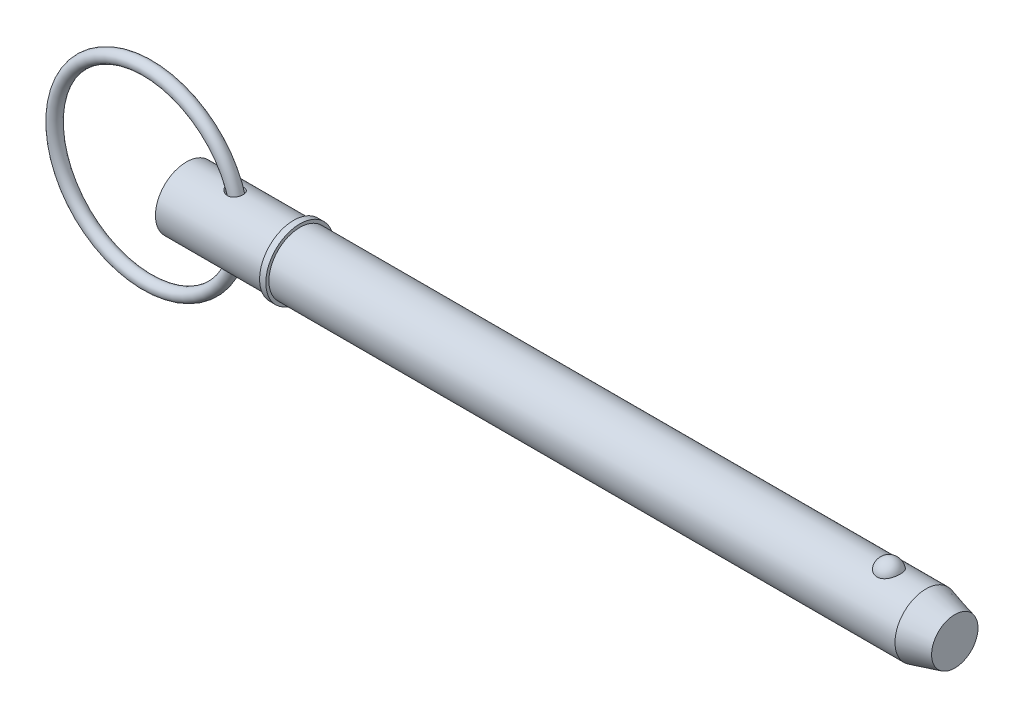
ISO-10303-21;
HEADER;
FILE_DESCRIPTION(('STEP AP214'),'2;1');
FILE_NAME('part.step','',(''),(''),'','','');
FILE_SCHEMA(('AUTOMOTIVE_DESIGN { 1 0 10303 214 1 1 1 1 }'));
ENDSEC;
DATA;
#1=APPLICATION_CONTEXT('core data for automotive mechanical design processes');
#2=APPLICATION_PROTOCOL_DEFINITION('international standard','automotive_design',2000,#1);
#3=PRODUCT_CONTEXT('',#1,'mechanical');
#4=PRODUCT('Part','Part','',(#3));
#5=PRODUCT_RELATED_PRODUCT_CATEGORY('part','',(#4));
#6=PRODUCT_DEFINITION_FORMATION('','',#4);
#7=PRODUCT_DEFINITION_CONTEXT('part definition',#1,'design');
#8=PRODUCT_DEFINITION('design','',#6,#7);
#9=PRODUCT_DEFINITION_SHAPE('','',#8);
#10=(LENGTH_UNIT() NAMED_UNIT(*) SI_UNIT(.MILLI.,.METRE.));
#11=(NAMED_UNIT(*) PLANE_ANGLE_UNIT() SI_UNIT($,.RADIAN.));
#12=(NAMED_UNIT(*) SI_UNIT($,.STERADIAN.) SOLID_ANGLE_UNIT());
#13=UNCERTAINTY_MEASURE_WITH_UNIT(LENGTH_MEASURE(1.E-05),#10,'distance_accuracy_value','');
#14=(GEOMETRIC_REPRESENTATION_CONTEXT(3) GLOBAL_UNCERTAINTY_ASSIGNED_CONTEXT((#13)) GLOBAL_UNIT_ASSIGNED_CONTEXT((#10,
#11,#12)) REPRESENTATION_CONTEXT('',''));
#15=CARTESIAN_POINT('',(0.,0.,0.));
#16=DIRECTION('',(0.,0.,1.));
#17=DIRECTION('',(1.,0.,0.));
#18=AXIS2_PLACEMENT_3D('',#15,#16,#17);
#19=CARTESIAN_POINT('',(-11.9894358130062,0.,0.));
#20=DIRECTION('',(0.,0.,1.));
#21=DIRECTION('',(1.,0.,0.));
#22=AXIS2_PLACEMENT_3D('',#19,#20,#21);
#23=TOROIDAL_SURFACE('',#22,28.575,1.905);
#24=CARTESIAN_POINT('',(18.4905641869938,0.,0.));
#25=VERTEX_POINT('',#24);
#26=VERTEX_LOOP('',#25);
#27=FACE_BOUND('',#26,.T.);
#28=ADVANCED_FACE('P0_F12',(#27),#23,.T.);
#29=CLOSED_SHELL('',(#28));
#30=MANIFOLD_SOLID_BREP('P0_B1',#29);
#31=CARTESIAN_POINT('',(0.,0.,0.));
#32=DIRECTION('',(1.,0.,0.));
#33=DIRECTION('',(0.,0.,-1.));
#34=AXIS2_PLACEMENT_3D('',#31,#32,#33);
#35=CYLINDRICAL_SURFACE('',#34,9.525);
#36=CARTESIAN_POINT('',(12.9513882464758,9.41921920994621,-1.41559473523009));
#37=CARTESIAN_POINT('',(13.0504692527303,9.40163924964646,-1.53256769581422));
#38=CARTESIAN_POINT('',(13.1602600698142,9.38319823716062,-1.64044593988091));
#39=CARTESIAN_POINT('',(13.3966485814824,9.34687220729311,-1.83618480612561));
#40=CARTESIAN_POINT('',(13.5232761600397,9.32898824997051,-1.92400906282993));
#41=CARTESIAN_POINT('',(13.78900694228,9.29593183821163,-2.07784697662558));
#42=CARTESIAN_POINT('',(13.9280753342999,9.28075215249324,-2.14391921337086));
#43=CARTESIAN_POINT('',(14.2153444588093,9.25488828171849,-2.25295850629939));
#44=CARTESIAN_POINT('',(14.3635415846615,9.24420233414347,-2.295934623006));
#45=CARTESIAN_POINT('',(14.669669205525,9.22859713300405,-2.3579005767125));
#46=CARTESIAN_POINT('',(14.8277567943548,9.22385123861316,-2.37617053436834));
#47=CARTESIAN_POINT('',(15.1447573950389,9.22170813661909,-2.38448481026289));
#48=CARTESIAN_POINT('',(15.3036699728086,9.22430739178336,-2.3745427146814));
#49=CARTESIAN_POINT('',(15.6046561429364,9.2363636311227,-2.32717331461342));
#50=CARTESIAN_POINT('',(15.7470893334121,9.24528216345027,-2.29190131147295));
#51=CARTESIAN_POINT('',(16.0228763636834,9.26842607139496,-2.19642882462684));
#52=CARTESIAN_POINT('',(16.1562346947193,9.28264879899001,-2.1362407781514));
#53=CARTESIAN_POINT('',(16.3991522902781,9.31332263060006,-1.99805318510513));
#54=CARTESIAN_POINT('',(16.5097585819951,9.32951023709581,-1.92182839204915));
#55=CARTESIAN_POINT('',(16.7159974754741,9.36298467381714,-1.75147176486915));
#56=CARTESIAN_POINT('',(16.811631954,9.38027136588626,-1.65734217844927));
#57=CARTESIAN_POINT('',(16.9833240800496,9.41356881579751,-1.45618916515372));
#58=CARTESIAN_POINT('',(17.0597719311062,9.42959946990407,-1.34950141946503));
#59=CARTESIAN_POINT('',(17.1939538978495,9.45905380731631,-1.1246201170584));
#60=CARTESIAN_POINT('',(17.2516877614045,9.4724774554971,-1.00642640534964));
#61=CARTESIAN_POINT('',(17.3474400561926,9.49535683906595,-0.760990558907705));
#62=CARTESIAN_POINT('',(17.3853184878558,9.50478431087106,-0.633691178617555));
#63=CARTESIAN_POINT('',(17.4399027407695,9.51852575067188,-0.374363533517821));
#64=CARTESIAN_POINT('',(17.4566077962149,9.52283953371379,-0.242335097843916));
#65=CARTESIAN_POINT('',(17.4685150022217,9.52590431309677,0.0235692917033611));
#66=CARTESIAN_POINT('',(17.4635842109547,9.52462091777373,0.157451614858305));
#67=CARTESIAN_POINT('',(17.4320243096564,9.5165501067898,0.422467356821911));
#68=CARTESIAN_POINT('',(17.4053947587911,9.50976257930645,0.553600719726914));
#69=CARTESIAN_POINT('',(17.3310009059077,9.49140797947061,0.809490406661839));
#70=CARTESIAN_POINT('',(17.2832204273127,9.47983724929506,0.93424176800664));
#71=CARTESIAN_POINT('',(17.1676219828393,9.45318034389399,1.1736825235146));
#72=CARTESIAN_POINT('',(17.0998044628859,9.43809424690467,1.28837214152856));
#73=CARTESIAN_POINT('',(16.9461013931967,9.40614962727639,1.50393386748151));
#74=CARTESIAN_POINT('',(16.8602910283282,9.38929862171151,1.6048606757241));
#75=CARTESIAN_POINT('',(16.6726759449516,9.35566510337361,1.79055313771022));
#76=CARTESIAN_POINT('',(16.5708731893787,9.33888258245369,1.87532077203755));
#77=CARTESIAN_POINT('',(16.3550631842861,9.30741331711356,2.02572386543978));
#78=CARTESIAN_POINT('',(16.2411701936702,9.29270956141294,2.09151983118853));
#79=CARTESIAN_POINT('',(16.0037488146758,9.26681293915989,2.20343355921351));
#80=CARTESIAN_POINT('',(15.8802207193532,9.25561996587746,2.24955191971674));
#81=CARTESIAN_POINT('',(15.6262451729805,9.23779438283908,2.32167613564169));
#82=CARTESIAN_POINT('',(15.4957570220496,9.23119272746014,2.34754561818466));
#83=CARTESIAN_POINT('',(15.2322153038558,9.22318493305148,2.37881082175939));
#84=CARTESIAN_POINT('',(15.0991611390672,9.22178001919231,2.3842017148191));
#85=CARTESIAN_POINT('',(14.8267609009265,9.22414647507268,2.37503099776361));
#86=CARTESIAN_POINT('',(14.6874545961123,9.22819578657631,2.35939810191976));
#87=CARTESIAN_POINT('',(14.412976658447,9.24129253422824,2.30756034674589));
#88=CARTESIAN_POINT('',(14.2778066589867,9.25034191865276,2.27134746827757));
#89=CARTESIAN_POINT('',(14.0027915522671,9.27334688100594,2.17561454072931));
#90=CARTESIAN_POINT('',(13.8635960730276,9.28766658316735,2.11431132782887));
#91=CARTESIAN_POINT('',(13.5969045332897,9.31925368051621,1.97041856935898));
#92=CARTESIAN_POINT('',(13.4694182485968,9.33652350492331,1.88781145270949));
#93=CARTESIAN_POINT('',(13.2243568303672,9.37286659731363,1.69844580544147));
#94=CARTESIAN_POINT('',(13.1075060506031,9.39198626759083,1.5907521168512));
#95=CARTESIAN_POINT('',(12.8957171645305,9.42881110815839,1.35544651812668));
#96=CARTESIAN_POINT('',(12.8007455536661,9.44651841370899,1.22786557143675));
#97=CARTESIAN_POINT('',(12.6580495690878,9.4741137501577,0.98872437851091));
#98=CARTESIAN_POINT('',(12.604453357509,9.4848570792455,0.880756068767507));
#99=CARTESIAN_POINT('',(12.515693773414,9.50295777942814,0.657225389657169));
#100=CARTESIAN_POINT('',(12.4805142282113,9.51031812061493,0.54166978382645));
#101=CARTESIAN_POINT('',(12.4305797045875,9.52083647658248,0.305475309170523));
#102=CARTESIAN_POINT('',(12.4159122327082,9.52397648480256,0.184816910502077));
#103=CARTESIAN_POINT('',(12.408320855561,9.52559626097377,-0.0572308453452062));
#104=CARTESIAN_POINT('',(12.4153963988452,9.52407614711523,-0.178620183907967));
#105=CARTESIAN_POINT('',(12.4495068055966,9.51684301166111,-0.409566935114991));
#106=CARTESIAN_POINT('',(12.4750931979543,9.51143444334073,-0.519353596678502));
#107=CARTESIAN_POINT('',(12.543120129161,9.49733710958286,-0.733285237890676));
#108=CARTESIAN_POINT('',(12.5855568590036,9.4886490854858,-0.837431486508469));
#109=CARTESIAN_POINT('',(12.6780792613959,9.47023833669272,-1.02356028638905));
#110=CARTESIAN_POINT('',(12.7261842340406,9.46084463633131,-1.10657511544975));
#111=CARTESIAN_POINT('',(12.8319313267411,9.44081892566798,-1.26610577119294));
#112=CARTESIAN_POINT('',(12.8895756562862,9.43018662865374,-1.34262008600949));
#113=CARTESIAN_POINT('',(12.9513882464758,9.41921920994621,-1.41559473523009));
#114=B_SPLINE_CURVE_WITH_KNOTS('',3,(#36,#37,#38,#39,#40,#41,#42,#43,#44,#45,#46,#47,#48,#49,
#50,#51,#52,#53,#54,#55,#56,#57,#58,#59,#60,#61,#62,#63,#64,#65,#66,#67,#68,#69,#70,#71,#72,#73,
#74,#75,#76,#77,#78,#79,#80,#81,#82,#83,#84,#85,#86,#87,#88,#89,#90,#91,#92,#93,#94,#95,#96,#97,
#98,#99,#100,#101,#102,#103,#104,#105,#106,#107,#108,#109,#110,#111,#112,#113),.UNSPECIFIED.,
.T.,.F.,(4,2,2,2,2,2,2,2,2,2,2,2,2,2,2,2,2,2,2,2,2,2,2,2,2,2,2,2,2,2,2,2,2,2,2,2,2,2,4),(0.,
0.462524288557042,0.925880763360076,1.3879789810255,1.84989578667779,2.32500103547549,
2.79987752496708,3.23851602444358,3.67693583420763,4.08084875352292,4.48471100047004,
4.87953549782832,5.27436531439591,5.67194282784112,6.0695347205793,6.46957303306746,
6.86961947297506,7.26997240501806,7.67031642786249,8.06901977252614,8.46767421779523,
8.86284969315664,9.25801315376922,9.65581560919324,10.0537118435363,10.4726706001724,
10.8917927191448,11.3481090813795,11.8048030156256,12.2824769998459,12.7594145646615,
13.1209614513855,13.4821903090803,13.8449555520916,14.2077115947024,14.5447865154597,
14.881785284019,15.170268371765,15.4588183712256),.UNSPECIFIED.);
#115=CARTESIAN_POINT('',(12.9513882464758,9.41921920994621,-1.41559473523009));
#116=VERTEX_POINT('',#115);
#117=EDGE_CURVE('P1_E42',#116,#116,#114,.T.);
#118=ORIENTED_EDGE('',*,*,#117,.T.);
#119=EDGE_LOOP('',(#118));
#120=FACE_BOUND('',#119,.T.);
#121=CARTESIAN_POINT('',(0.,0.,0.));
#122=DIRECTION('',(1.,0.,0.));
#123=DIRECTION('',(0.,0.,-1.));
#124=AXIS2_PLACEMENT_3D('',#121,#122,#123);
#125=CIRCLE('',#124,9.525);
#126=CARTESIAN_POINT('',(0.,0.,-9.525));
#127=VERTEX_POINT('',#126);
#128=EDGE_CURVE('P1_E9',#127,#127,#125,.T.);
#129=ORIENTED_EDGE('',*,*,#128,.T.);
#130=EDGE_LOOP('',(#129));
#131=FACE_BOUND('',#130,.T.);
#132=CARTESIAN_POINT('',(33.025,0.,0.));
#133=DIRECTION('',(1.,0.,0.));
#134=DIRECTION('',(0.,0.,-1.));
#135=AXIS2_PLACEMENT_3D('',#132,#133,#134);
#136=CIRCLE('',#135,9.525);
#137=CARTESIAN_POINT('',(33.025,0.,-9.525));
#138=VERTEX_POINT('',#137);
#139=EDGE_CURVE('P1_E25',#138,#138,#136,.T.);
#140=ORIENTED_EDGE('',*,*,#139,.F.);
#141=EDGE_LOOP('',(#140));
#142=FACE_BOUND('',#141,.T.);
#143=CARTESIAN_POINT('',(12.9513882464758,-9.41921920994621,-1.41559473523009));
#144=CARTESIAN_POINT('',(12.8706569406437,-9.43354320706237,-1.32028288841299));
#145=CARTESIAN_POINT('',(12.7970077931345,-9.44729974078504,-1.21890449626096));
#146=CARTESIAN_POINT('',(12.6667099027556,-9.47239055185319,-1.00546491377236));
#147=CARTESIAN_POINT('',(12.6100480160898,-9.48372669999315,-0.893412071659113));
#148=CARTESIAN_POINT('',(12.5163428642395,-9.50281544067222,-0.660202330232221));
#149=CARTESIAN_POINT('',(12.4794216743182,-9.51054569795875,-0.538993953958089));
#150=CARTESIAN_POINT('',(12.4282252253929,-9.52133525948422,-0.29167282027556));
#151=CARTESIAN_POINT('',(12.4139371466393,-9.52439720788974,-0.165562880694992));
#152=CARTESIAN_POINT('',(12.4092595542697,-9.52539668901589,0.0763263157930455));
#153=CARTESIAN_POINT('',(12.4169377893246,-9.5237485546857,0.192070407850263));
#154=CARTESIAN_POINT('',(12.4515961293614,-9.51640070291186,0.420478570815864));
#155=CARTESIAN_POINT('',(12.4785770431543,-9.51070081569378,0.533142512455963));
#156=CARTESIAN_POINT('',(12.5496371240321,-9.49599978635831,0.750537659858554));
#157=CARTESIAN_POINT('',(12.5934215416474,-9.48705569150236,0.855370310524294));
#158=CARTESIAN_POINT('',(12.6960201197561,-9.46670226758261,1.05710432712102));
#159=CARTESIAN_POINT('',(12.754838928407,-9.45529217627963,1.15400322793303));
#160=CARTESIAN_POINT('',(12.8926588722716,-9.42958102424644,1.34883014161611));
#161=CARTESIAN_POINT('',(12.9731843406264,-9.41509922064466,1.44565277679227));
#162=CARTESIAN_POINT('',(13.1473692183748,-9.38554264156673,1.62653953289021));
#163=CARTESIAN_POINT('',(13.2410364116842,-9.37046751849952,1.71059603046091));
#164=CARTESIAN_POINT('',(13.454392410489,-9.33867330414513,1.87697964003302));
#165=CARTESIAN_POINT('',(13.5758667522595,-9.32205896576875,1.95704323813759));
#166=CARTESIAN_POINT('',(13.8299208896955,-9.29140277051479,2.09777392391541));
#167=CARTESIAN_POINT('',(13.9625074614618,-9.27736250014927,2.15842906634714));
#168=CARTESIAN_POINT('',(14.2477938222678,-9.25234849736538,2.26337318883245));
#169=CARTESIAN_POINT('',(14.4012368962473,-9.2417532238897,2.30575283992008));
#170=CARTESIAN_POINT('',(14.7134258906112,-9.22706044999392,2.36387471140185));
#171=CARTESIAN_POINT('',(14.8721705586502,-9.22296142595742,2.37962317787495));
#172=CARTESIAN_POINT('',(15.1841930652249,-9.22219798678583,2.3825815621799));
#173=CARTESIAN_POINT('',(15.3374581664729,-9.22526675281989,2.37081567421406));
#174=CARTESIAN_POINT('',(15.6390558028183,-9.23821642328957,2.31984408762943));
#175=CARTESIAN_POINT('',(15.7873916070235,-9.24809271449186,2.28065697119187));
#176=CARTESIAN_POINT('',(16.0605055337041,-9.27231045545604,2.17997072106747));
#177=CARTESIAN_POINT('',(16.1861988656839,-9.28616347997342,2.12082794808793));
#178=CARTESIAN_POINT('',(16.4248737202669,-9.31689725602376,1.98144352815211));
#179=CARTESIAN_POINT('',(16.5378583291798,-9.33377726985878,1.90120701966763));
#180=CARTESIAN_POINT('',(16.7424913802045,-9.36766057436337,1.72629138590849));
#181=CARTESIAN_POINT('',(16.8349077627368,-9.38461836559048,1.63249912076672));
#182=CARTESIAN_POINT('',(17.0025959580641,-9.41752009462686,1.43052052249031));
#183=CARTESIAN_POINT('',(17.0778684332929,-9.43346407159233,1.32233474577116));
#184=CARTESIAN_POINT('',(17.2093311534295,-9.46256896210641,1.09477833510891));
#185=CARTESIAN_POINT('',(17.2655443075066,-9.47573320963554,0.975421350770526));
#186=CARTESIAN_POINT('',(17.3577240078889,-9.49788660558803,0.72876499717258));
#187=CARTESIAN_POINT('',(17.3936897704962,-9.5068755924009,0.601465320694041));
#188=CARTESIAN_POINT('',(17.4447894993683,-9.51977728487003,0.341392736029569));
#189=CARTESIAN_POINT('',(17.4597470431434,-9.52364698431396,0.208583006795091));
#190=CARTESIAN_POINT('',(17.467935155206,-9.52575588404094,-0.0577507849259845));
#191=CARTESIAN_POINT('',(17.4611651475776,-9.52399493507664,-0.191274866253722));
#192=CARTESIAN_POINT('',(17.4259933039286,-9.51501704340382,-0.455658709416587));
#193=CARTESIAN_POINT('',(17.3975278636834,-9.50778405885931,-0.586509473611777));
#194=CARTESIAN_POINT('',(17.3195245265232,-9.48862442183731,-0.841413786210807));
#195=CARTESIAN_POINT('',(17.2699864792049,-9.47669773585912,-0.965467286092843));
#196=CARTESIAN_POINT('',(17.1510794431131,-9.44947793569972,-1.20302860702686));
#197=CARTESIAN_POINT('',(17.0817421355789,-9.43419020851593,-1.31655289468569));
#198=CARTESIAN_POINT('',(16.9249035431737,-9.40193593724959,-1.52999797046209));
#199=CARTESIAN_POINT('',(16.8374037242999,-9.38496952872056,-1.62991985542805));
#200=CARTESIAN_POINT('',(16.6472525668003,-9.35139745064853,-1.81261591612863));
#201=CARTESIAN_POINT('',(16.544718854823,-9.33479003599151,-1.89551219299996));
#202=CARTESIAN_POINT('',(16.3268885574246,-9.30366076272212,-2.04284430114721));
#203=CARTESIAN_POINT('',(16.2115933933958,-9.28913867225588,-2.10728218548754));
#204=CARTESIAN_POINT('',(15.9721327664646,-9.26380878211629,-2.21598517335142));
#205=CARTESIAN_POINT('',(15.8480095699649,-9.25298455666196,-2.26033977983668));
#206=CARTESIAN_POINT('',(15.5939970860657,-9.23601616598,-2.32870721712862));
#207=CARTESIAN_POINT('',(15.4641070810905,-9.22987258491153,-2.35271750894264));
#208=CARTESIAN_POINT('',(15.1982340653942,-9.22261892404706,-2.38099747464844));
#209=CARTESIAN_POINT('',(15.0621840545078,-9.22166165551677,-2.38466791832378));
#210=CARTESIAN_POINT('',(14.7911713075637,-9.22504733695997,-2.37153091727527));
#211=CARTESIAN_POINT('',(14.6562088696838,-9.22939169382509,-2.35471803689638));
#212=CARTESIAN_POINT('',(14.3799999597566,-9.24325361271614,-2.29972931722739));
#213=CARTESIAN_POINT('',(14.2390842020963,-9.25314817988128,-2.25998976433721));
#214=CARTESIAN_POINT('',(13.9651910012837,-9.2770918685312,-2.15959208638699));
#215=CARTESIAN_POINT('',(13.8322212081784,-9.29114491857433,-2.09891417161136));
#216=CARTESIAN_POINT('',(13.5621642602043,-9.32369066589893,-1.94960068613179));
#217=CARTESIAN_POINT('',(13.4264724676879,-9.34251276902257,-1.85849626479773));
#218=CARTESIAN_POINT('',(13.1736579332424,-9.38095091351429,-1.6535412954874));
#219=CARTESIAN_POINT('',(13.0565182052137,-9.40056620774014,-1.53971177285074));
#220=CARTESIAN_POINT('',(12.9513882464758,-9.41921920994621,-1.41559473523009));
#221=B_SPLINE_CURVE_WITH_KNOTS('',3,(#143,#144,#145,#146,#147,#148,#149,#150,#151,#152,#153,
#154,#155,#156,#157,#158,#159,#160,#161,#162,#163,#164,#165,#166,#167,#168,#169,#170,#171,#172,
#173,#174,#175,#176,#177,#178,#179,#180,#181,#182,#183,#184,#185,#186,#187,#188,#189,#190,#191,
#192,#193,#194,#195,#196,#197,#198,#199,#200,#201,#202,#203,#204,#205,#206,#207,#208,#209,#210,
#211,#212,#213,#214,#215,#216,#217,#218,#219,#220),.UNSPECIFIED.,.T.,.F.,(4,2,2,2,2,2,2,2,2,2,2,
2,2,2,2,2,2,2,2,2,2,2,2,2,2,2,2,2,2,2,2,2,2,2,2,2,2,2,4),(0.,0.37674646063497,0.753200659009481,
1.13195666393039,1.51049805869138,1.85679105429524,2.20309856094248,2.54359033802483,
2.88418751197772,3.26301611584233,3.64207005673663,4.07954912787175,4.51729693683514,
4.99355673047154,5.46970480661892,5.92841231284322,6.38680927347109,6.80346940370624,
7.2200281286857,7.61642768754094,8.01281192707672,8.4087180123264,8.8046394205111,
9.20386620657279,9.60310357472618,10.0035159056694,10.4039310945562,10.8037091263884,
11.2034549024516,11.6002252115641,11.9969513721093,12.3918916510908,12.7868812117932,
13.1934480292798,13.6001227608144,14.038511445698,14.4773156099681,14.9683748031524,
15.4589817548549),.UNSPECIFIED.);
#222=CARTESIAN_POINT('',(12.9513882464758,-9.41921920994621,-1.41559473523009));
#223=VERTEX_POINT('',#222);
#224=EDGE_CURVE('P1_E17',#223,#223,#221,.T.);
#225=ORIENTED_EDGE('',*,*,#224,.T.);
#226=EDGE_LOOP('',(#225));
#227=FACE_BOUND('',#226,.T.);
#228=ADVANCED_FACE('P1_F13',(#120,#131,#142,#227),#35,.T.);
#229=CARTESIAN_POINT('',(0.,0.,0.));
#230=DIRECTION('',(1.,0.,0.));
#231=DIRECTION('',(0.,0.,-1.));
#232=AXIS2_PLACEMENT_3D('',#229,#230,#231);
#233=CYLINDRICAL_SURFACE('',#232,9.525);
#234=CARTESIAN_POINT('',(227.643054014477,0.,0.));
#235=DIRECTION('',(1.,0.,0.));
#236=DIRECTION('',(0.,0.,-1.));
#237=AXIS2_PLACEMENT_3D('',#234,#235,#236);
#238=CIRCLE('',#237,9.525);
#239=CARTESIAN_POINT('',(227.643054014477,0.,-9.525));
#240=VERTEX_POINT('',#239);
#241=EDGE_CURVE('P1_E99',#240,#240,#238,.T.);
#242=ORIENTED_EDGE('',*,*,#241,.F.);
#243=EDGE_LOOP('',(#242));
#244=FACE_BOUND('',#243,.T.);
#245=CARTESIAN_POINT('',(34.93,0.,0.));
#246=DIRECTION('',(1.,0.,0.));
#247=DIRECTION('',(0.,0.,-1.));
#248=AXIS2_PLACEMENT_3D('',#245,#246,#247);
#249=CIRCLE('',#248,9.525);
#250=CARTESIAN_POINT('',(34.93,0.,-9.525));
#251=VERTEX_POINT('',#250);
#252=EDGE_CURVE('P1_E96',#251,#251,#249,.T.);
#253=ORIENTED_EDGE('',*,*,#252,.T.);
#254=EDGE_LOOP('',(#253));
#255=FACE_BOUND('',#254,.T.);
#256=CARTESIAN_POINT('',(216.245757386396,8.80405803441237,3.63513233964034));
#257=CARTESIAN_POINT('',(216.151676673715,8.80405953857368,3.63513053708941));
#258=CARTESIAN_POINT('',(216.057561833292,8.80561325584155,3.63137461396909));
#259=CARTESIAN_POINT('',(215.870012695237,8.8117774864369,3.61638665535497));
#260=CARTESIAN_POINT('',(215.776578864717,8.81638992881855,3.60514990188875));
#261=CARTESIAN_POINT('',(215.497945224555,8.83467114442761,3.56024627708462));
#262=CARTESIAN_POINT('',(215.314691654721,8.85278327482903,3.5153862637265));
#263=CARTESIAN_POINT('',(214.959509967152,8.89871214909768,3.39742145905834));
#264=CARTESIAN_POINT('',(214.787553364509,8.92650327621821,3.32439116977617));
#265=CARTESIAN_POINT('',(214.458707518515,8.9887481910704,3.15220244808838));
#266=CARTESIAN_POINT('',(214.301811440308,9.02319893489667,3.05305594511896));
#267=CARTESIAN_POINT('',(214.002214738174,9.09629186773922,2.82797815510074));
#268=CARTESIAN_POINT('',(213.860060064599,9.13502685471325,2.70135138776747));
#269=CARTESIAN_POINT('',(213.598299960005,9.21186572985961,2.42641932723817));
#270=CARTESIAN_POINT('',(213.478701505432,9.24996941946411,2.27810735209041));
#271=CARTESIAN_POINT('',(213.259645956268,9.32341082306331,1.95652290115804));
#272=CARTESIAN_POINT('',(213.161317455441,9.35855090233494,1.78243511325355));
#273=CARTESIAN_POINT('',(212.993819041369,9.42045142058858,1.419372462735));
#274=CARTESIAN_POINT('',(212.924651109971,9.44721128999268,1.23039658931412));
#275=CARTESIAN_POINT('',(212.816199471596,9.48990641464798,0.840370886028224));
#276=CARTESIAN_POINT('',(212.777288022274,9.50570658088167,0.639202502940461));
#277=CARTESIAN_POINT('',(212.731555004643,9.52433146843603,0.232664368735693));
#278=CARTESIAN_POINT('',(212.724732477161,9.52715657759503,0.0272947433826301));
#279=CARTESIAN_POINT('',(212.743255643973,9.51956918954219,-0.380478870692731));
#280=CARTESIAN_POINT('',(212.768405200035,9.50923740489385,-0.582893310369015));
#281=CARTESIAN_POINT('',(212.85002537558,9.47651897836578,-0.980293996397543));
#282=CARTESIAN_POINT('',(212.906496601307,9.45413210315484,-1.17528009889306));
#283=CARTESIAN_POINT('',(213.049719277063,9.39954044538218,-1.55263697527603));
#284=CARTESIAN_POINT('',(213.136512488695,9.36732213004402,-1.73498993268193));
#285=CARTESIAN_POINT('',(213.338610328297,9.29640700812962,-2.08177763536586));
#286=CARTESIAN_POINT('',(213.453917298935,9.25770966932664,-2.24621090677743));
#287=CARTESIAN_POINT('',(213.711264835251,9.17775604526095,-2.5533833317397));
#288=CARTESIAN_POINT('',(213.853434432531,9.136488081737,-2.696011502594));
#289=CARTESIAN_POINT('',(214.16089985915,9.05620497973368,-2.95451229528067));
#290=CARTESIAN_POINT('',(214.326193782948,9.01718965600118,-3.070387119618));
#291=CARTESIAN_POINT('',(214.672052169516,8.94680019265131,-3.26976836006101));
#292=CARTESIAN_POINT('',(214.852227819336,8.91528408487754,-3.35389750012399));
#293=CARTESIAN_POINT('',(215.225651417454,8.86272514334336,-3.49043503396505));
#294=CARTESIAN_POINT('',(215.418894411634,8.84167836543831,-3.54285537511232));
#295=CARTESIAN_POINT('',(215.802503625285,8.81348056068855,-3.61241306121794));
#296=CARTESIAN_POINT('',(215.992525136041,8.80568348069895,-3.6311933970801));
#297=CARTESIAN_POINT('',(216.373190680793,8.80289410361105,-3.63795342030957));
#298=CARTESIAN_POINT('',(216.563834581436,8.80789922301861,-3.62593932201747));
#299=CARTESIAN_POINT('',(216.934007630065,8.82974915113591,-3.57238430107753));
#300=CARTESIAN_POINT('',(217.113697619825,8.84621463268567,-3.53178890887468));
#301=CARTESIAN_POINT('',(217.463422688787,8.88875330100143,-3.42331083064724));
#302=CARTESIAN_POINT('',(217.633456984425,8.91482726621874,-3.35542593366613));
#303=CARTESIAN_POINT('',(217.963237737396,8.97448239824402,-3.19248225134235));
#304=CARTESIAN_POINT('',(218.122680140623,9.00821446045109,-3.0968647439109));
#305=CARTESIAN_POINT('',(218.423513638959,9.07935398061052,-2.88162736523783));
#306=CARTESIAN_POINT('',(218.564900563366,9.11676228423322,-2.76200196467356));
#307=CARTESIAN_POINT('',(218.83331931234,9.19347419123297,-2.49516285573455));
#308=CARTESIAN_POINT('',(218.959275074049,9.23277872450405,-2.34686614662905));
#309=CARTESIAN_POINT('',(219.185522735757,9.3073761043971,-2.0309368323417));
#310=CARTESIAN_POINT('',(219.28581004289,9.34266823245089,-1.86330077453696));
#311=CARTESIAN_POINT('',(219.461514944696,9.40674710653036,-1.50744893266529));
#312=CARTESIAN_POINT('',(219.536041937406,9.43529176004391,-1.31874876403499));
#313=CARTESIAN_POINT('',(219.65416505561,9.48144132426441,-0.930631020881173));
#314=CARTESIAN_POINT('',(219.697760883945,9.49904612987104,-0.73121334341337));
#315=CARTESIAN_POINT('',(219.753158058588,9.52153148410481,-0.327147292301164));
#316=CARTESIAN_POINT('',(219.764935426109,9.52640243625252,-0.122495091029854));
#317=CARTESIAN_POINT('',(219.756382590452,9.5228957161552,0.286018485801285));
#318=CARTESIAN_POINT('',(219.73605305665,9.5145183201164,0.48987987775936));
#319=CARTESIAN_POINT('',(219.663884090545,9.48544083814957,0.889994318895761));
#320=CARTESIAN_POINT('',(219.612199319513,9.46480124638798,1.08627971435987));
#321=CARTESIAN_POINT('',(219.478491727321,9.4133389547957,1.46682086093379));
#322=CARTESIAN_POINT('',(219.396466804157,9.38251554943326,1.65107577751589));
#323=CARTESIAN_POINT('',(219.20319292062,9.31365636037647,2.00346348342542));
#324=CARTESIAN_POINT('',(219.091783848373,9.27558138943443,2.17150083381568));
#325=CARTESIAN_POINT('',(218.842294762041,9.19638714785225,2.48563115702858));
#326=CARTESIAN_POINT('',(218.704216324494,9.15526805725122,2.63172542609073));
#327=CARTESIAN_POINT('',(218.404843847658,9.07465393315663,2.89750997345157));
#328=CARTESIAN_POINT('',(218.243610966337,9.03515496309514,3.01726776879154));
#329=CARTESIAN_POINT('',(217.901613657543,8.96227564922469,3.22732920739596));
#330=CARTESIAN_POINT('',(217.720841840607,8.92889763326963,3.31762165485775));
#331=CARTESIAN_POINT('',(217.351445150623,8.8734538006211,3.46314419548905));
#332=CARTESIAN_POINT('',(217.16332371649,8.85102983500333,3.51950082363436));
#333=CARTESIAN_POINT('',(216.87578699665,8.82666967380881,3.57993683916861));
#334=CARTESIAN_POINT('',(216.779133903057,8.82009725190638,3.5960621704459));
#335=CARTESIAN_POINT('',(216.584677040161,8.81020897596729,3.62022512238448));
#336=CARTESIAN_POINT('',(216.48687410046,8.80689090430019,3.62826825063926));
#337=CARTESIAN_POINT('',(216.341224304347,8.80445615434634,3.63416760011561));
#338=CARTESIAN_POINT('',(216.293495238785,8.80405727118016,3.63513325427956));
#339=CARTESIAN_POINT('',(216.245757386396,8.80405803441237,3.63513233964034));
#340=B_SPLINE_CURVE_WITH_KNOTS('',3,(#256,#257,#258,#259,#260,#261,#262,#263,#264,#265,#266,
#267,#268,#269,#270,#271,#272,#273,#274,#275,#276,#277,#278,#279,#280,#281,#282,#283,#284,#285,
#286,#287,#288,#289,#290,#291,#292,#293,#294,#295,#296,#297,#298,#299,#300,#301,#302,#303,#304,
#305,#306,#307,#308,#309,#310,#311,#312,#313,#314,#315,#316,#317,#318,#319,#320,#321,#322,#323,
#324,#325,#326,#327,#328,#329,#330,#331,#332,#333,#334,#335,#336,#337,#338,#339),.UNSPECIFIED.,
.T.,.F.,(4,2,2,2,2,2,2,2,2,2,2,2,2,2,2,2,2,2,2,2,2,2,2,2,2,2,2,2,2,2,2,2,2,2,2,2,2,2,2,2,2,4),
(0.,0.282202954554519,0.564584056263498,1.13017050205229,1.69427128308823,2.25811483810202,
2.83836627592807,3.41879688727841,4.02497117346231,4.63118665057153,5.2447475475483,
5.85829010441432,6.46808687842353,7.07789545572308,7.68854723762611,8.29924920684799,
8.91296283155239,9.52662591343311,10.1275338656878,10.7282152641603,11.2986646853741,
11.8689989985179,12.4213015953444,12.973648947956,13.5380053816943,14.1024919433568,
14.695298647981,15.2882113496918,15.8999469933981,16.5116885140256,17.1238909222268,
17.7360805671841,18.3452748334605,18.9545113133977,19.5671386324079,20.179729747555,
20.7907316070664,21.4019653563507,21.9915938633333,22.2859053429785,22.5800161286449,
22.7232098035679),.UNSPECIFIED.);
#341=CARTESIAN_POINT('',(216.245757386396,8.80405803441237,3.63513233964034));
#342=VERTEX_POINT('',#341);
#343=EDGE_CURVE('P1_E34',#342,#342,#340,.T.);
#344=ORIENTED_EDGE('',*,*,#343,.T.);
#345=EDGE_LOOP('',(#344));
#346=FACE_BOUND('',#345,.T.);
#347=ADVANCED_FACE('P1_F46',(#244,#255,#346),#233,.T.);
#348=CARTESIAN_POINT('',(0.,0.,0.));
#349=DIRECTION('',(-1.,0.,0.));
#350=DIRECTION('',(0.,0.,1.));
#351=AXIS2_PLACEMENT_3D('',#348,#349,#350);
#352=PLANE('',#351);
#353=ORIENTED_EDGE('',*,*,#128,.F.);
#354=EDGE_LOOP('',(#353));
#355=FACE_BOUND('',#354,.T.);
#356=ADVANCED_FACE('P1_F15',(#355),#352,.T.);
#357=CARTESIAN_POINT('',(33.025,9.525,0.));
#358=DIRECTION('',(-1.,0.,0.));
#359=DIRECTION('',(0.,0.,1.));
#360=AXIS2_PLACEMENT_3D('',#357,#358,#359);
#361=PLANE('',#360);
#362=ORIENTED_EDGE('',*,*,#139,.T.);
#363=EDGE_LOOP('',(#362));
#364=FACE_BOUND('',#363,.T.);
#365=CARTESIAN_POINT('',(33.025,0.,0.));
#366=DIRECTION('',(1.,0.,0.));
#367=DIRECTION('',(0.,0.,-1.));
#368=AXIS2_PLACEMENT_3D('',#365,#366,#367);
#369=CIRCLE('',#368,10.4775);
#370=CARTESIAN_POINT('',(33.025,0.,-10.4775));
#371=VERTEX_POINT('',#370);
#372=EDGE_CURVE('P1_E30',#371,#371,#369,.T.);
#373=ORIENTED_EDGE('',*,*,#372,.F.);
#374=EDGE_LOOP('',(#373));
#375=FACE_BOUND('',#374,.T.);
#376=ADVANCED_FACE('P1_F81',(#364,#375),#361,.T.);
#377=CARTESIAN_POINT('',(0.,0.,0.));
#378=DIRECTION('',(1.,0.,0.));
#379=DIRECTION('',(0.,0.,-1.));
#380=AXIS2_PLACEMENT_3D('',#377,#378,#379);
#381=CYLINDRICAL_SURFACE('',#380,10.4775);
#382=ORIENTED_EDGE('',*,*,#372,.T.);
#383=EDGE_LOOP('',(#382));
#384=FACE_BOUND('',#383,.T.);
#385=CARTESIAN_POINT('',(34.93,0.,0.));
#386=DIRECTION('',(1.,0.,0.));
#387=DIRECTION('',(0.,0.,-1.));
#388=AXIS2_PLACEMENT_3D('',#385,#386,#387);
#389=CIRCLE('',#388,10.4775);
#390=CARTESIAN_POINT('',(34.93,0.,-10.4775));
#391=VERTEX_POINT('',#390);
#392=EDGE_CURVE('P1_E95',#391,#391,#389,.T.);
#393=ORIENTED_EDGE('',*,*,#392,.F.);
#394=EDGE_LOOP('',(#393));
#395=FACE_BOUND('',#394,.T.);
#396=ADVANCED_FACE('P1_F68',(#384,#395),#381,.T.);
#397=CARTESIAN_POINT('',(34.93,10.4775,0.));
#398=DIRECTION('',(1.,0.,0.));
#399=DIRECTION('',(0.,0.,-1.));
#400=AXIS2_PLACEMENT_3D('',#397,#398,#399);
#401=PLANE('',#400);
#402=ORIENTED_EDGE('',*,*,#392,.T.);
#403=EDGE_LOOP('',(#402));
#404=FACE_BOUND('',#403,.T.);
#405=ORIENTED_EDGE('',*,*,#252,.F.);
#406=EDGE_LOOP('',(#405));
#407=FACE_BOUND('',#406,.T.);
#408=ADVANCED_FACE('P1_F62',(#404,#407),#401,.T.);
#409=CARTESIAN_POINT('',(236.53,0.,0.));
#410=DIRECTION('',(-1.,0.,0.));
#411=DIRECTION('',(0.,0.,1.));
#412=AXIS2_PLACEMENT_3D('',#409,#410,#411);
#413=CONICAL_SURFACE('',#412,7.14375000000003,0.26179938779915);
#414=ORIENTED_EDGE('',*,*,#241,.T.);
#415=EDGE_LOOP('',(#414));
#416=FACE_BOUND('',#415,.T.);
#417=CARTESIAN_POINT('',(236.53,0.,0.));
#418=DIRECTION('',(1.,0.,0.));
#419=DIRECTION('',(0.,0.,-1.));
#420=AXIS2_PLACEMENT_3D('',#417,#418,#419);
#421=CIRCLE('',#420,7.14375000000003);
#422=CARTESIAN_POINT('',(236.53,0.,-7.14375000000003));
#423=VERTEX_POINT('',#422);
#424=EDGE_CURVE('P1_E41',#423,#423,#421,.T.);
#425=ORIENTED_EDGE('',*,*,#424,.F.);
#426=EDGE_LOOP('',(#425));
#427=FACE_BOUND('',#426,.T.);
#428=ADVANCED_FACE('P1_F59',(#416,#427),#413,.T.);
#429=CARTESIAN_POINT('',(236.53,7.14375000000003,0.));
#430=DIRECTION('',(1.,0.,0.));
#431=DIRECTION('',(0.,0.,-1.));
#432=AXIS2_PLACEMENT_3D('',#429,#430,#431);
#433=PLANE('',#432);
#434=ORIENTED_EDGE('',*,*,#424,.T.);
#435=EDGE_LOOP('',(#434));
#436=FACE_BOUND('',#435,.T.);
#437=ADVANCED_FACE('P1_F55',(#436),#433,.T.);
#438=CARTESIAN_POINT('',(216.245757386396,8.57249999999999,0.));
#439=DIRECTION('',(-1.,0.,0.));
#440=DIRECTION('',(0.,1.,0.));
#441=AXIS2_PLACEMENT_3D('',#438,#439,#440);
#442=SPHERICAL_SURFACE('',#441,3.64249999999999);
#443=ORIENTED_EDGE('',*,*,#343,.F.);
#444=EDGE_LOOP('',(#443));
#445=FACE_BOUND('',#444,.T.);
#446=ADVANCED_FACE('P1_F50',(#445),#442,.T.);
#447=CARTESIAN_POINT('',(-11.9894358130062,0.,0.));
#448=DIRECTION('',(0.,0.,1.));
#449=DIRECTION('',(1.,0.,0.));
#450=AXIS2_PLACEMENT_3D('',#447,#448,#449);
#451=TOROIDAL_SURFACE('',#450,28.575,2.38125);
#452=ORIENTED_EDGE('',*,*,#224,.F.);
#453=EDGE_LOOP('',(#452));
#454=FACE_BOUND('',#453,.T.);
#455=ORIENTED_EDGE('',*,*,#117,.F.);
#456=EDGE_LOOP('',(#455));
#457=FACE_BOUND('',#456,.T.);
#458=ADVANCED_FACE('P1_F54',(#454,#457),#451,.F.);
#459=CLOSED_SHELL('',(#228,#347,#356,#376,#396,#408,#428,#437,#446,#458));
#460=MANIFOLD_SOLID_BREP('P1_B1',#459);
#461=ADVANCED_BREP_SHAPE_REPRESENTATION('',(#18,#30,#460),#14);
#462=SHAPE_DEFINITION_REPRESENTATION(#9,#461);
ENDSEC;
END-ISO-10303-21;
